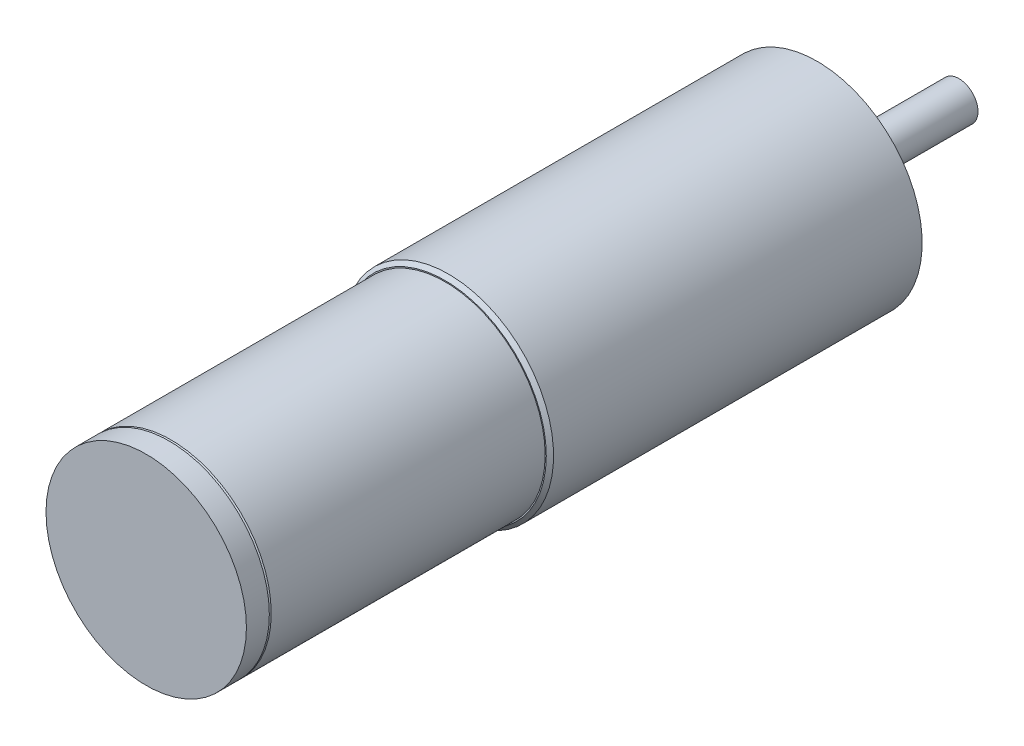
ISO-10303-21;
HEADER;
FILE_DESCRIPTION(('STEP AP214'),'2;1');
FILE_NAME('part.step','',(''),(''),'','','');
FILE_SCHEMA(('AUTOMOTIVE_DESIGN { 1 0 10303 214 1 1 1 1 }'));
ENDSEC;
DATA;
#1=APPLICATION_CONTEXT('core data for automotive mechanical design processes');
#2=APPLICATION_PROTOCOL_DEFINITION('international standard','automotive_design',2000,#1);
#3=PRODUCT_CONTEXT('',#1,'mechanical');
#4=PRODUCT('Part','Part','',(#3));
#5=PRODUCT_RELATED_PRODUCT_CATEGORY('part','',(#4));
#6=PRODUCT_DEFINITION_FORMATION('','',#4);
#7=PRODUCT_DEFINITION_CONTEXT('part definition',#1,'design');
#8=PRODUCT_DEFINITION('design','',#6,#7);
#9=PRODUCT_DEFINITION_SHAPE('','',#8);
#10=(LENGTH_UNIT() NAMED_UNIT(*) SI_UNIT(.MILLI.,.METRE.));
#11=(NAMED_UNIT(*) PLANE_ANGLE_UNIT() SI_UNIT($,.RADIAN.));
#12=(NAMED_UNIT(*) SI_UNIT($,.STERADIAN.) SOLID_ANGLE_UNIT());
#13=UNCERTAINTY_MEASURE_WITH_UNIT(LENGTH_MEASURE(1.E-05),#10,'distance_accuracy_value','');
#14=(GEOMETRIC_REPRESENTATION_CONTEXT(3) GLOBAL_UNCERTAINTY_ASSIGNED_CONTEXT((#13)) GLOBAL_UNIT_ASSIGNED_CONTEXT((#10,
#11,#12)) REPRESENTATION_CONTEXT('',''));
#15=CARTESIAN_POINT('',(0.,0.,0.));
#16=DIRECTION('',(0.,0.,1.));
#17=DIRECTION('',(1.,0.,0.));
#18=AXIS2_PLACEMENT_3D('',#15,#16,#17);
#19=CARTESIAN_POINT('',(0.,0.,-3.14999999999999));
#20=DIRECTION('',(0.,0.,-0.999999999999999));
#21=DIRECTION('',(-1.,0.,0.));
#22=AXIS2_PLACEMENT_3D('',#19,#20,#21);
#23=PLANE('',#22);
#24=CARTESIAN_POINT('',(0.,0.,-3.14999999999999));
#25=DIRECTION('',(0.,0.,-0.999999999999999));
#26=DIRECTION('',(-1.,0.,0.));
#27=AXIS2_PLACEMENT_3D('',#24,#25,#26);
#28=CIRCLE('',#27,5.);
#29=CARTESIAN_POINT('',(5.,0.,-3.14999999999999));
#30=VERTEX_POINT('',#29);
#31=EDGE_CURVE('E368',#30,#30,#28,.T.);
#32=ORIENTED_EDGE('',*,*,#31,.T.);
#33=EDGE_LOOP('',(#32));
#34=FACE_BOUND('',#33,.T.);
#35=CARTESIAN_POINT('',(0.,0.,-3.14999999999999));
#36=DIRECTION('',(0.,0.,-0.999999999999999));
#37=DIRECTION('',(-1.,0.,0.));
#38=AXIS2_PLACEMENT_3D('',#35,#36,#37);
#39=CIRCLE('',#38,2.);
#40=CARTESIAN_POINT('',(1.99999999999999,0.,-3.14999999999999));
#41=VERTEX_POINT('',#40);
#42=EDGE_CURVE('E366',#41,#41,#39,.F.);
#43=ORIENTED_EDGE('',*,*,#42,.T.);
#44=EDGE_LOOP('',(#43));
#45=FACE_BOUND('',#44,.T.);
#46=ADVANCED_FACE('F348',(#34,#45),#23,.T.);
#47=CARTESIAN_POINT('',(0.,0.,0.));
#48=DIRECTION('',(0.,0.,0.999999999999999));
#49=DIRECTION('',(1.,0.,0.));
#50=AXIS2_PLACEMENT_3D('',#47,#48,#49);
#51=PLANE('',#50);
#52=CARTESIAN_POINT('',(0.,0.,0.));
#53=DIRECTION('',(0.,0.,0.999999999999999));
#54=DIRECTION('',(1.,0.,0.));
#55=AXIS2_PLACEMENT_3D('',#52,#53,#54);
#56=CIRCLE('',#55,11.);
#57=CARTESIAN_POINT('',(-11.,-2.63677968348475E-13,0.));
#58=VERTEX_POINT('',#57);
#59=EDGE_CURVE('E376',#58,#58,#56,.T.);
#60=ORIENTED_EDGE('',*,*,#59,.F.);
#61=EDGE_LOOP('',(#60));
#62=FACE_BOUND('',#61,.T.);
#63=CARTESIAN_POINT('',(0.,0.,0.));
#64=DIRECTION('',(0.,0.,0.999999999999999));
#65=DIRECTION('',(1.,0.,0.));
#66=AXIS2_PLACEMENT_3D('',#63,#64,#65);
#67=CIRCLE('',#66,5.);
#68=CARTESIAN_POINT('',(5.,0.,0.));
#69=VERTEX_POINT('',#68);
#70=EDGE_CURVE('E359',#69,#69,#67,.F.);
#71=ORIENTED_EDGE('',*,*,#70,.F.);
#72=EDGE_LOOP('',(#71));
#73=FACE_BOUND('',#72,.T.);
#74=ADVANCED_FACE('F405',(#62,#73),#51,.F.);
#75=CARTESIAN_POINT('',(0.,-2.63677968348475E-13,39.));
#76=DIRECTION('',(0.,0.,0.999999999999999));
#77=DIRECTION('',(1.,0.,0.));
#78=AXIS2_PLACEMENT_3D('',#75,#76,#77);
#79=PLANE('',#78);
#80=CARTESIAN_POINT('',(0.,-2.63677968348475E-13,39.));
#81=DIRECTION('',(0.,0.,0.999999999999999));
#82=DIRECTION('',(1.,0.,0.));
#83=AXIS2_PLACEMENT_3D('',#80,#81,#82);
#84=CIRCLE('',#83,10.619);
#85=CARTESIAN_POINT('',(-10.619,-2.63677968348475E-13,39.));
#86=VERTEX_POINT('',#85);
#87=EDGE_CURVE('E373',#86,#86,#84,.T.);
#88=ORIENTED_EDGE('',*,*,#87,.T.);
#89=EDGE_LOOP('',(#88));
#90=FACE_BOUND('',#89,.T.);
#91=CARTESIAN_POINT('',(0.,-2.63677968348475E-13,39.));
#92=DIRECTION('',(0.,0.,0.999999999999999));
#93=DIRECTION('',(1.,0.,0.));
#94=AXIS2_PLACEMENT_3D('',#91,#92,#93);
#95=CIRCLE('',#94,10.5);
#96=CARTESIAN_POINT('',(-10.5,0.,39.));
#97=VERTEX_POINT('',#96);
#98=EDGE_CURVE('E379',#97,#97,#95,.T.);
#99=ORIENTED_EDGE('',*,*,#98,.F.);
#100=EDGE_LOOP('',(#99));
#101=FACE_BOUND('',#100,.T.);
#102=ADVANCED_FACE('F411',(#90,#101),#79,.T.);
#103=CARTESIAN_POINT('',(0.,-2.63677968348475E-13,39.));
#104=DIRECTION('',(0.,0.,-0.999999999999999));
#105=DIRECTION('',(-1.,0.,0.));
#106=AXIS2_PLACEMENT_3D('',#103,#104,#105);
#107=CYLINDRICAL_SURFACE('',#106,11.);
#108=CARTESIAN_POINT('',(0.,-2.63677968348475E-13,38.619));
#109=DIRECTION('',(0.,0.,0.999999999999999));
#110=DIRECTION('',(1.,0.,0.));
#111=AXIS2_PLACEMENT_3D('',#108,#109,#110);
#112=CIRCLE('',#111,11.);
#113=CARTESIAN_POINT('',(-11.,-2.63677968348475E-13,38.619));
#114=VERTEX_POINT('',#113);
#115=EDGE_CURVE('E363',#114,#114,#112,.F.);
#116=CARTESIAN_POINT('',(-11.,-2.63677968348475E-13,38.619));
#117=CARTESIAN_POINT('',(-11.,-2.63677968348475E-13,38.21671875));
#118=CARTESIAN_POINT('',(-11.,-2.63677968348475E-13,37.8144375));
#119=CARTESIAN_POINT('',(-11.,-2.63677968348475E-13,37.009875));
#120=CARTESIAN_POINT('',(-11.,-2.63677968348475E-13,36.60759375));
#121=CARTESIAN_POINT('',(-11.,-2.63677968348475E-13,35.80303125));
#122=CARTESIAN_POINT('',(-11.,-2.63677968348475E-13,35.40075));
#123=CARTESIAN_POINT('',(-11.,-2.63677968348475E-13,34.5961875));
#124=CARTESIAN_POINT('',(-11.,-2.63677968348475E-13,34.19390625));
#125=CARTESIAN_POINT('',(-11.,-2.63677968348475E-13,33.38934375));
#126=CARTESIAN_POINT('',(-11.,-2.63677968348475E-13,32.9870625));
#127=CARTESIAN_POINT('',(-11.,-2.63677968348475E-13,32.1825));
#128=CARTESIAN_POINT('',(-11.,-2.63677968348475E-13,31.78021875));
#129=CARTESIAN_POINT('',(-11.,-2.63677968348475E-13,30.97565625));
#130=CARTESIAN_POINT('',(-11.,-2.63677968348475E-13,30.573375));
#131=CARTESIAN_POINT('',(-11.,-2.63677968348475E-13,29.7688125));
#132=CARTESIAN_POINT('',(-11.,-2.63677968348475E-13,29.36653125));
#133=CARTESIAN_POINT('',(-11.,-2.63677968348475E-13,28.56196875));
#134=CARTESIAN_POINT('',(-11.,-2.63677968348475E-13,28.1596875));
#135=CARTESIAN_POINT('',(-11.,-2.63677968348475E-13,27.355125));
#136=CARTESIAN_POINT('',(-11.,-2.63677968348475E-13,26.95284375));
#137=CARTESIAN_POINT('',(-11.,-2.63677968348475E-13,26.14828125));
#138=CARTESIAN_POINT('',(-11.,-2.63677968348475E-13,25.746));
#139=CARTESIAN_POINT('',(-11.,-2.63677968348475E-13,24.9414375));
#140=CARTESIAN_POINT('',(-11.,-2.63677968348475E-13,24.53915625));
#141=CARTESIAN_POINT('',(-11.,-2.63677968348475E-13,23.73459375));
#142=CARTESIAN_POINT('',(-11.,-2.63677968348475E-13,23.3323125));
#143=CARTESIAN_POINT('',(-11.,-2.63677968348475E-13,22.52775));
#144=CARTESIAN_POINT('',(-11.,-2.63677968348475E-13,22.12546875));
#145=CARTESIAN_POINT('',(-11.,-2.63677968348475E-13,21.32090625));
#146=CARTESIAN_POINT('',(-11.,-2.63677968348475E-13,20.918625));
#147=CARTESIAN_POINT('',(-11.,-2.63677968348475E-13,20.1140625));
#148=CARTESIAN_POINT('',(-11.,-2.63677968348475E-13,19.71178125));
#149=CARTESIAN_POINT('',(-11.,-2.63677968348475E-13,18.90721875));
#150=CARTESIAN_POINT('',(-11.,-2.63677968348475E-13,18.5049375));
#151=CARTESIAN_POINT('',(-11.,-2.63677968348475E-13,17.700375));
#152=CARTESIAN_POINT('',(-11.,-2.63677968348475E-13,17.29809375));
#153=CARTESIAN_POINT('',(-11.,-2.63677968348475E-13,16.49353125));
#154=CARTESIAN_POINT('',(-11.,-2.63677968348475E-13,16.09125));
#155=CARTESIAN_POINT('',(-11.,-2.63677968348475E-13,15.2866875));
#156=CARTESIAN_POINT('',(-11.,-2.63677968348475E-13,14.88440625));
#157=CARTESIAN_POINT('',(-11.,-2.63677968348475E-13,14.07984375));
#158=CARTESIAN_POINT('',(-11.,-2.63677968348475E-13,13.6775625));
#159=CARTESIAN_POINT('',(-11.,-2.63677968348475E-13,12.873));
#160=CARTESIAN_POINT('',(-11.,-2.63677968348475E-13,12.47071875));
#161=CARTESIAN_POINT('',(-11.,-2.63677968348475E-13,11.66615625));
#162=CARTESIAN_POINT('',(-11.,-2.63677968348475E-13,11.263875));
#163=CARTESIAN_POINT('',(-11.,-2.63677968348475E-13,10.4593125));
#164=CARTESIAN_POINT('',(-11.,-2.63677968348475E-13,10.05703125));
#165=CARTESIAN_POINT('',(-11.,-2.63677968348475E-13,9.25246875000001));
#166=CARTESIAN_POINT('',(-11.,-2.63677968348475E-13,8.85018750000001));
#167=CARTESIAN_POINT('',(-11.,-2.63677968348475E-13,8.045625));
#168=CARTESIAN_POINT('',(-11.,-2.63677968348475E-13,7.64334375));
#169=CARTESIAN_POINT('',(-11.,-2.63677968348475E-13,6.83878125));
#170=CARTESIAN_POINT('',(-11.,-2.63677968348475E-13,6.4365));
#171=CARTESIAN_POINT('',(-11.,-2.63677968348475E-13,5.6319375));
#172=CARTESIAN_POINT('',(-11.,-2.63677968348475E-13,5.22965625));
#173=CARTESIAN_POINT('',(-11.,-2.63677968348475E-13,4.42509374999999));
#174=CARTESIAN_POINT('',(-11.,-2.63677968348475E-13,4.0228125));
#175=CARTESIAN_POINT('',(-11.,-2.63677968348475E-13,3.21825));
#176=CARTESIAN_POINT('',(-11.,-2.63677968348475E-13,2.81596875));
#177=CARTESIAN_POINT('',(-11.,-2.63677968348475E-13,2.01140625));
#178=CARTESIAN_POINT('',(-11.,-2.63677968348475E-13,1.609125));
#179=CARTESIAN_POINT('',(-11.,-2.63677968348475E-13,0.804562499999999));
#180=CARTESIAN_POINT('',(-11.,-2.63677968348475E-13,0.402281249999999));
#181=CARTESIAN_POINT('',(-11.,-2.63677968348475E-13,0.));
#182=B_SPLINE_CURVE_WITH_KNOTS('',3,(#116,#117,#118,#119,#120,#121,#122,#123,#124,#125,#126,
#127,#128,#129,#130,#131,#132,#133,#134,#135,#136,#137,#138,#139,#140,#141,#142,#143,#144,#145,
#146,#147,#148,#149,#150,#151,#152,#153,#154,#155,#156,#157,#158,#159,#160,#161,#162,#163,#164,
#165,#166,#167,#168,#169,#170,#171,#172,#173,#174,#175,#176,#177,#178,#179,#180,#181),
.UNSPECIFIED.,.F.,.F.,(4,2,2,2,2,2,2,2,2,2,2,2,2,2,2,2,2,2,2,2,2,2,2,2,2,2,2,2,2,2,2,2,4),(0.,
1.20684375,2.4136875,3.62053125,4.82737499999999,6.03421875,7.2410625,8.44790625,9.65475,
10.86159375,12.0684375,13.27528125,14.482125,15.68896875,16.8958125,18.10265625,19.3095,
20.51634375,21.7231875,22.93003125,24.136875,25.34371875,26.5505625,27.75740625,28.96425,
30.17109375,31.3779375,32.58478125,33.791625,34.99846875,36.2053125,37.41215625,38.619),.UNSPECIFIED.);
#183=EDGE_CURVE('BSEAM350',#114,#58,#182,.T.);
#184=ORIENTED_EDGE('',*,*,#115,.T.);
#185=ORIENTED_EDGE('',*,*,#59,.T.);
#186=ORIENTED_EDGE('',*,*,#183,.T.);
#187=ORIENTED_EDGE('',*,*,#183,.F.);
#188=EDGE_LOOP('',(#184,#186,#185,#187));
#189=FACE_BOUND('',#188,.T.);
#190=ADVANCED_FACE('F350',(#189),#107,.T.);
#191=CARTESIAN_POINT('',(0.,-2.63677968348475E-13,39.));
#192=DIRECTION('',(0.,0.,-0.999999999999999));
#193=DIRECTION('',(-1.,0.,0.));
#194=AXIS2_PLACEMENT_3D('',#191,#192,#193);
#195=CONICAL_SURFACE('',#194,10.619,0.785398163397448);
#196=CARTESIAN_POINT('',(-11.,-2.63677968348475E-13,38.619));
#197=CARTESIAN_POINT('',(-10.99603125,-2.63677968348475E-13,38.62296875));
#198=CARTESIAN_POINT('',(-10.9920625,-2.63677968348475E-13,38.6269375));
#199=CARTESIAN_POINT('',(-10.984125,-2.63677968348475E-13,38.634875));
#200=CARTESIAN_POINT('',(-10.98015625,-2.63677968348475E-13,38.63884375));
#201=CARTESIAN_POINT('',(-10.97221875,-2.63677968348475E-13,38.64678125));
#202=CARTESIAN_POINT('',(-10.96825,-2.63677968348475E-13,38.65075));
#203=CARTESIAN_POINT('',(-10.9603125,-2.63677968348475E-13,38.6586875));
#204=CARTESIAN_POINT('',(-10.95634375,-2.63677968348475E-13,38.66265625));
#205=CARTESIAN_POINT('',(-10.94840625,-2.63677968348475E-13,38.67059375));
#206=CARTESIAN_POINT('',(-10.9444375,-2.63677968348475E-13,38.6745625));
#207=CARTESIAN_POINT('',(-10.9365,-2.63677968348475E-13,38.6825));
#208=CARTESIAN_POINT('',(-10.93253125,-2.63677968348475E-13,38.68646875));
#209=CARTESIAN_POINT('',(-10.92459375,-2.63677968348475E-13,38.69440625));
#210=CARTESIAN_POINT('',(-10.920625,-2.63677968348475E-13,38.698375));
#211=CARTESIAN_POINT('',(-10.9126875,-2.63677968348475E-13,38.7063125));
#212=CARTESIAN_POINT('',(-10.90871875,-2.63677968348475E-13,38.71028125));
#213=CARTESIAN_POINT('',(-10.90078125,-2.63677968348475E-13,38.71821875));
#214=CARTESIAN_POINT('',(-10.8968125,-2.63677968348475E-13,38.7221875));
#215=CARTESIAN_POINT('',(-10.888875,-2.63677968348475E-13,38.730125));
#216=CARTESIAN_POINT('',(-10.88490625,-2.63677968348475E-13,38.73409375));
#217=CARTESIAN_POINT('',(-10.87696875,-2.63677968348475E-13,38.74203125));
#218=CARTESIAN_POINT('',(-10.873,-2.63677968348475E-13,38.746));
#219=CARTESIAN_POINT('',(-10.8650625,-2.63677968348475E-13,38.7539375));
#220=CARTESIAN_POINT('',(-10.86109375,-2.63677968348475E-13,38.75790625));
#221=CARTESIAN_POINT('',(-10.85315625,-2.63677968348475E-13,38.76584375));
#222=CARTESIAN_POINT('',(-10.8491875,-2.63677968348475E-13,38.7698125));
#223=CARTESIAN_POINT('',(-10.84125,-2.63677968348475E-13,38.77775));
#224=CARTESIAN_POINT('',(-10.83728125,-2.63677968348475E-13,38.78171875));
#225=CARTESIAN_POINT('',(-10.82934375,-2.63677968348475E-13,38.78965625));
#226=CARTESIAN_POINT('',(-10.825375,-2.63677968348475E-13,38.793625));
#227=CARTESIAN_POINT('',(-10.8174375,-2.63677968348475E-13,38.8015625));
#228=CARTESIAN_POINT('',(-10.81346875,-2.63677968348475E-13,38.80553125));
#229=CARTESIAN_POINT('',(-10.80553125,-2.63677968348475E-13,38.81346875));
#230=CARTESIAN_POINT('',(-10.8015625,-2.63677968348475E-13,38.8174375));
#231=CARTESIAN_POINT('',(-10.793625,-2.63677968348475E-13,38.825375));
#232=CARTESIAN_POINT('',(-10.78965625,-2.63677968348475E-13,38.82934375));
#233=CARTESIAN_POINT('',(-10.78171875,-2.63677968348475E-13,38.83728125));
#234=CARTESIAN_POINT('',(-10.77775,-2.63677968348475E-13,38.84125));
#235=CARTESIAN_POINT('',(-10.7698125,-2.63677968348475E-13,38.8491875));
#236=CARTESIAN_POINT('',(-10.76584375,-2.63677968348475E-13,38.85315625));
#237=CARTESIAN_POINT('',(-10.75790625,-2.63677968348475E-13,38.86109375));
#238=CARTESIAN_POINT('',(-10.7539375,-2.63677968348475E-13,38.8650625));
#239=CARTESIAN_POINT('',(-10.746,-2.63677968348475E-13,38.873));
#240=CARTESIAN_POINT('',(-10.74203125,-2.63677968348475E-13,38.87696875));
#241=CARTESIAN_POINT('',(-10.73409375,-2.63677968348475E-13,38.88490625));
#242=CARTESIAN_POINT('',(-10.730125,-2.63677968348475E-13,38.888875));
#243=CARTESIAN_POINT('',(-10.7221875,-2.63677968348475E-13,38.8968125));
#244=CARTESIAN_POINT('',(-10.71821875,-2.63677968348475E-13,38.90078125));
#245=CARTESIAN_POINT('',(-10.71028125,-2.63677968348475E-13,38.90871875));
#246=CARTESIAN_POINT('',(-10.7063125,-2.63677968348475E-13,38.9126875));
#247=CARTESIAN_POINT('',(-10.698375,-2.63677968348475E-13,38.920625));
#248=CARTESIAN_POINT('',(-10.69440625,-2.63677968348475E-13,38.92459375));
#249=CARTESIAN_POINT('',(-10.68646875,-2.63677968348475E-13,38.93253125));
#250=CARTESIAN_POINT('',(-10.6825,-2.63677968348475E-13,38.9365));
#251=CARTESIAN_POINT('',(-10.6745625,-2.63677968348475E-13,38.9444375));
#252=CARTESIAN_POINT('',(-10.67059375,-2.63677968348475E-13,38.94840625));
#253=CARTESIAN_POINT('',(-10.66265625,-2.63677968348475E-13,38.95634375));
#254=CARTESIAN_POINT('',(-10.6586875,-2.63677968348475E-13,38.9603125));
#255=CARTESIAN_POINT('',(-10.65075,-2.63677968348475E-13,38.96825));
#256=CARTESIAN_POINT('',(-10.64678125,-2.63677968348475E-13,38.97221875));
#257=CARTESIAN_POINT('',(-10.63884375,-2.63677968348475E-13,38.98015625));
#258=CARTESIAN_POINT('',(-10.634875,-2.63677968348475E-13,38.984125));
#259=CARTESIAN_POINT('',(-10.6269375,-2.63677968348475E-13,38.9920625));
#260=CARTESIAN_POINT('',(-10.62296875,-2.63677968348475E-13,38.99603125));
#261=CARTESIAN_POINT('',(-10.619,-2.63677968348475E-13,39.));
#262=B_SPLINE_CURVE_WITH_KNOTS('',3,(#196,#197,#198,#199,#200,#201,#202,#203,#204,#205,#206,
#207,#208,#209,#210,#211,#212,#213,#214,#215,#216,#217,#218,#219,#220,#221,#222,#223,#224,#225,
#226,#227,#228,#229,#230,#231,#232,#233,#234,#235,#236,#237,#238,#239,#240,#241,#242,#243,#244,
#245,#246,#247,#248,#249,#250,#251,#252,#253,#254,#255,#256,#257,#258,#259,#260,#261),
.UNSPECIFIED.,.F.,.F.,(4,2,2,2,2,2,2,2,2,2,2,2,2,2,2,2,2,2,2,2,2,2,2,2,2,2,2,2,2,2,2,2,4),(0.,
0.016837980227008,0.0336759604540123,0.0505139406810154,0.0673519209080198,0.0841899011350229,
0.101027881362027,0.11786586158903,0.134703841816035,0.151541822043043,0.168379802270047,
0.18521778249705,0.202055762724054,0.218893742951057,0.235731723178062,0.252569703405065,
0.269407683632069,0.286245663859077,0.303083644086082,0.319921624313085,0.336759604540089,
0.353597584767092,0.370435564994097,0.3872735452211,0.404111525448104,0.420949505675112,
0.437787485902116,0.454625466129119,0.471463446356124,0.488301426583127,0.505139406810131,
0.521977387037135,0.538815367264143),.UNSPECIFIED.);
#263=EDGE_CURVE('BSEAM426',#114,#86,#262,.T.);
#264=ORIENTED_EDGE('',*,*,#115,.F.);
#265=ORIENTED_EDGE('',*,*,#87,.F.);
#266=ORIENTED_EDGE('',*,*,#263,.T.);
#267=ORIENTED_EDGE('',*,*,#263,.F.);
#268=EDGE_LOOP('',(#264,#266,#265,#267));
#269=FACE_BOUND('',#268,.T.);
#270=ADVANCED_FACE('F426',(#269),#195,.T.);
#271=CARTESIAN_POINT('',(0.,0.,67.9));
#272=DIRECTION('',(0.,0.,-0.999999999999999));
#273=DIRECTION('',(-1.,0.,0.));
#274=AXIS2_PLACEMENT_3D('',#271,#272,#273);
#275=CYLINDRICAL_SURFACE('',#274,10.5);
#276=CARTESIAN_POINT('',(0.,0.,67.7));
#277=DIRECTION('',(0.,0.,0.999999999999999));
#278=DIRECTION('',(1.,0.,0.));
#279=AXIS2_PLACEMENT_3D('',#276,#277,#278);
#280=CIRCLE('',#279,10.5);
#281=CARTESIAN_POINT('',(-10.5,0.,67.7));
#282=VERTEX_POINT('',#281);
#283=EDGE_CURVE('E10',#282,#282,#280,.F.);
#284=CARTESIAN_POINT('',(-10.5,0.,67.7));
#285=CARTESIAN_POINT('',(-10.5,0.,67.4010416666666));
#286=CARTESIAN_POINT('',(-10.5,0.,67.1020833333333));
#287=CARTESIAN_POINT('',(-10.5,0.,66.5041666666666));
#288=CARTESIAN_POINT('',(-10.5,0.,66.2052083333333));
#289=CARTESIAN_POINT('',(-10.5,0.,65.6072916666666));
#290=CARTESIAN_POINT('',(-10.5,0.,65.3083333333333));
#291=CARTESIAN_POINT('',(-10.5,0.,64.7104166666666));
#292=CARTESIAN_POINT('',(-10.5,0.,64.4114583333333));
#293=CARTESIAN_POINT('',(-10.5,0.,63.8135416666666));
#294=CARTESIAN_POINT('',(-10.5,0.,63.5145833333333));
#295=CARTESIAN_POINT('',(-10.5,0.,62.9166666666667));
#296=CARTESIAN_POINT('',(-10.5,0.,62.6177083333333));
#297=CARTESIAN_POINT('',(-10.5,0.,62.0197916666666));
#298=CARTESIAN_POINT('',(-10.5,0.,61.7208333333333));
#299=CARTESIAN_POINT('',(-10.5,0.,61.1229166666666));
#300=CARTESIAN_POINT('',(-10.5,0.,60.8239583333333));
#301=CARTESIAN_POINT('',(-10.5,0.,60.2260416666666));
#302=CARTESIAN_POINT('',(-10.5,0.,59.9270833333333));
#303=CARTESIAN_POINT('',(-10.5,0.,59.3291666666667));
#304=CARTESIAN_POINT('',(-10.5,0.,59.0302083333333));
#305=CARTESIAN_POINT('',(-10.5,0.,58.4322916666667));
#306=CARTESIAN_POINT('',(-10.5,0.,58.1333333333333));
#307=CARTESIAN_POINT('',(-10.5,0.,57.5354166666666));
#308=CARTESIAN_POINT('',(-10.5,0.,57.2364583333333));
#309=CARTESIAN_POINT('',(-10.5,0.,56.6385416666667));
#310=CARTESIAN_POINT('',(-10.5,0.,56.3395833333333));
#311=CARTESIAN_POINT('',(-10.5,0.,55.7416666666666));
#312=CARTESIAN_POINT('',(-10.5,0.,55.4427083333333));
#313=CARTESIAN_POINT('',(-10.5,0.,54.8447916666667));
#314=CARTESIAN_POINT('',(-10.5,0.,54.5458333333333));
#315=CARTESIAN_POINT('',(-10.5,0.,53.9479166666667));
#316=CARTESIAN_POINT('',(-10.5,0.,53.6489583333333));
#317=CARTESIAN_POINT('',(-10.5,0.,53.0510416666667));
#318=CARTESIAN_POINT('',(-10.5,0.,52.7520833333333));
#319=CARTESIAN_POINT('',(-10.5,0.,52.1541666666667));
#320=CARTESIAN_POINT('',(-10.5,0.,51.8552083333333));
#321=CARTESIAN_POINT('',(-10.5,0.,51.2572916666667));
#322=CARTESIAN_POINT('',(-10.5,0.,50.9583333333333));
#323=CARTESIAN_POINT('',(-10.5,0.,50.3604166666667));
#324=CARTESIAN_POINT('',(-10.5,0.,50.0614583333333));
#325=CARTESIAN_POINT('',(-10.5,0.,49.4635416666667));
#326=CARTESIAN_POINT('',(-10.5,0.,49.1645833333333));
#327=CARTESIAN_POINT('',(-10.5,0.,48.5666666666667));
#328=CARTESIAN_POINT('',(-10.5,0.,48.2677083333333));
#329=CARTESIAN_POINT('',(-10.5,0.,47.6697916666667));
#330=CARTESIAN_POINT('',(-10.5,0.,47.3708333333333));
#331=CARTESIAN_POINT('',(-10.5,0.,46.7729166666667));
#332=CARTESIAN_POINT('',(-10.5,0.,46.4739583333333));
#333=CARTESIAN_POINT('',(-10.5,0.,45.8760416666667));
#334=CARTESIAN_POINT('',(-10.5,0.,45.5770833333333));
#335=CARTESIAN_POINT('',(-10.5,0.,44.9791666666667));
#336=CARTESIAN_POINT('',(-10.5,0.,44.6802083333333));
#337=CARTESIAN_POINT('',(-10.5,0.,44.0822916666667));
#338=CARTESIAN_POINT('',(-10.5,0.,43.7833333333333));
#339=CARTESIAN_POINT('',(-10.5,0.,43.1854166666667));
#340=CARTESIAN_POINT('',(-10.5,0.,42.8864583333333));
#341=CARTESIAN_POINT('',(-10.5,0.,42.2885416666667));
#342=CARTESIAN_POINT('',(-10.5,0.,41.9895833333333));
#343=CARTESIAN_POINT('',(-10.5,0.,41.3916666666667));
#344=CARTESIAN_POINT('',(-10.5,0.,41.0927083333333));
#345=CARTESIAN_POINT('',(-10.5,0.,40.4947916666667));
#346=CARTESIAN_POINT('',(-10.5,0.,40.1958333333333));
#347=CARTESIAN_POINT('',(-10.5,0.,39.5979166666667));
#348=CARTESIAN_POINT('',(-10.5,0.,39.2989583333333));
#349=CARTESIAN_POINT('',(-10.5,0.,39.));
#350=B_SPLINE_CURVE_WITH_KNOTS('',3,(#284,#285,#286,#287,#288,#289,#290,#291,#292,#293,#294,
#295,#296,#297,#298,#299,#300,#301,#302,#303,#304,#305,#306,#307,#308,#309,#310,#311,#312,#313,
#314,#315,#316,#317,#318,#319,#320,#321,#322,#323,#324,#325,#326,#327,#328,#329,#330,#331,#332,
#333,#334,#335,#336,#337,#338,#339,#340,#341,#342,#343,#344,#345,#346,#347,#348,#349),
.UNSPECIFIED.,.F.,.F.,(4,2,2,2,2,2,2,2,2,2,2,2,2,2,2,2,2,2,2,2,2,2,2,2,2,2,2,2,2,2,2,2,4),(0.,
0.896874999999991,1.79375,2.69062499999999,3.58749999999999,4.48437499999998,5.38124999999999,
6.27812499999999,7.17499999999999,8.07187499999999,8.96874999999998,9.86562499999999,10.7625,
11.659375,12.55625,13.453125,14.35,15.246875,16.14375,17.040625,17.9375,18.834375,19.73125,
20.628125,21.525,22.421875,23.31875,24.215625,25.1125,26.009375,26.90625,27.803125,28.7),.UNSPECIFIED.);
#351=EDGE_CURVE('BSEAM422',#282,#97,#350,.T.);
#352=ORIENTED_EDGE('',*,*,#283,.T.);
#353=ORIENTED_EDGE('',*,*,#98,.T.);
#354=ORIENTED_EDGE('',*,*,#351,.T.);
#355=ORIENTED_EDGE('',*,*,#351,.F.);
#356=EDGE_LOOP('',(#352,#354,#353,#355));
#357=FACE_BOUND('',#356,.T.);
#358=ADVANCED_FACE('F422',(#357),#275,.T.);
#359=CARTESIAN_POINT('',(0.,0.,-3.14999999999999));
#360=DIRECTION('',(0.,0.,0.999999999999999));
#361=DIRECTION('',(1.,0.,0.));
#362=AXIS2_PLACEMENT_3D('',#359,#360,#361);
#363=CYLINDRICAL_SURFACE('',#362,5.);
#364=CARTESIAN_POINT('',(5.,0.,-3.14999999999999));
#365=CARTESIAN_POINT('',(5.,0.,-3.11718749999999));
#366=CARTESIAN_POINT('',(5.,0.,-3.08437499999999));
#367=CARTESIAN_POINT('',(5.,0.,-3.01874999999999));
#368=CARTESIAN_POINT('',(5.,0.,-2.98593749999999));
#369=CARTESIAN_POINT('',(5.,0.,-2.92031249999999));
#370=CARTESIAN_POINT('',(5.,0.,-2.88749999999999));
#371=CARTESIAN_POINT('',(5.,0.,-2.82187499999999));
#372=CARTESIAN_POINT('',(5.,0.,-2.78906249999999));
#373=CARTESIAN_POINT('',(5.,0.,-2.72343749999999));
#374=CARTESIAN_POINT('',(5.,0.,-2.69062499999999));
#375=CARTESIAN_POINT('',(5.,0.,-2.62499999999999));
#376=CARTESIAN_POINT('',(5.,0.,-2.59218749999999));
#377=CARTESIAN_POINT('',(5.,0.,-2.52656249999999));
#378=CARTESIAN_POINT('',(5.,0.,-2.49374999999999));
#379=CARTESIAN_POINT('',(5.,0.,-2.42812499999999));
#380=CARTESIAN_POINT('',(5.,0.,-2.39531249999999));
#381=CARTESIAN_POINT('',(5.,0.,-2.32968749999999));
#382=CARTESIAN_POINT('',(5.,0.,-2.29687499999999));
#383=CARTESIAN_POINT('',(5.,0.,-2.23124999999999));
#384=CARTESIAN_POINT('',(5.,0.,-2.19843749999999));
#385=CARTESIAN_POINT('',(5.,0.,-2.13281249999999));
#386=CARTESIAN_POINT('',(5.,0.,-2.09999999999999));
#387=CARTESIAN_POINT('',(5.,0.,-2.03437499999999));
#388=CARTESIAN_POINT('',(5.,0.,-2.00156249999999));
#389=CARTESIAN_POINT('',(5.,0.,-1.93593749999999));
#390=CARTESIAN_POINT('',(5.,0.,-1.90312499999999));
#391=CARTESIAN_POINT('',(5.,0.,-1.83749999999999));
#392=CARTESIAN_POINT('',(5.,0.,-1.80468749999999));
#393=CARTESIAN_POINT('',(5.,0.,-1.73906249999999));
#394=CARTESIAN_POINT('',(5.,0.,-1.70624999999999));
#395=CARTESIAN_POINT('',(5.,0.,-1.64062499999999));
#396=CARTESIAN_POINT('',(5.,0.,-1.60781249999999));
#397=CARTESIAN_POINT('',(5.,0.,-1.54218749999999));
#398=CARTESIAN_POINT('',(5.,0.,-1.50937499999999));
#399=CARTESIAN_POINT('',(5.,0.,-1.44374999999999));
#400=CARTESIAN_POINT('',(5.,0.,-1.41093749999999));
#401=CARTESIAN_POINT('',(5.,0.,-1.34531249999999));
#402=CARTESIAN_POINT('',(5.,0.,-1.31249999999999));
#403=CARTESIAN_POINT('',(5.,0.,-1.24687499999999));
#404=CARTESIAN_POINT('',(5.,0.,-1.21406249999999));
#405=CARTESIAN_POINT('',(5.,0.,-1.14843749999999));
#406=CARTESIAN_POINT('',(5.,0.,-1.11562499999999));
#407=CARTESIAN_POINT('',(5.,0.,-1.04999999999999));
#408=CARTESIAN_POINT('',(5.,0.,-1.0171875));
#409=CARTESIAN_POINT('',(5.,0.,-0.951562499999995));
#410=CARTESIAN_POINT('',(5.,0.,-0.918749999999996));
#411=CARTESIAN_POINT('',(5.,0.,-0.853124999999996));
#412=CARTESIAN_POINT('',(5.,0.,-0.820312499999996));
#413=CARTESIAN_POINT('',(5.,0.,-0.754687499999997));
#414=CARTESIAN_POINT('',(5.,0.,-0.721874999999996));
#415=CARTESIAN_POINT('',(5.,0.,-0.656249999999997));
#416=CARTESIAN_POINT('',(5.,0.,-0.623437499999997));
#417=CARTESIAN_POINT('',(5.,0.,-0.557812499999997));
#418=CARTESIAN_POINT('',(5.,0.,-0.524999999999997));
#419=CARTESIAN_POINT('',(5.,0.,-0.459374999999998));
#420=CARTESIAN_POINT('',(5.,0.,-0.426562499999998));
#421=CARTESIAN_POINT('',(5.,0.,-0.360937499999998));
#422=CARTESIAN_POINT('',(5.,0.,-0.328124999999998));
#423=CARTESIAN_POINT('',(5.,0.,-0.262499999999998));
#424=CARTESIAN_POINT('',(5.,0.,-0.229687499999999));
#425=CARTESIAN_POINT('',(5.,0.,-0.164062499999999));
#426=CARTESIAN_POINT('',(5.,0.,-0.131249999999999));
#427=CARTESIAN_POINT('',(5.,0.,-0.0656249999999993));
#428=CARTESIAN_POINT('',(5.,0.,-0.0328124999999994));
#429=CARTESIAN_POINT('',(5.,0.,0.));
#430=B_SPLINE_CURVE_WITH_KNOTS('',3,(#364,#365,#366,#367,#368,#369,#370,#371,#372,#373,#374,
#375,#376,#377,#378,#379,#380,#381,#382,#383,#384,#385,#386,#387,#388,#389,#390,#391,#392,#393,
#394,#395,#396,#397,#398,#399,#400,#401,#402,#403,#404,#405,#406,#407,#408,#409,#410,#411,#412,
#413,#414,#415,#416,#417,#418,#419,#420,#421,#422,#423,#424,#425,#426,#427,#428,#429),
.UNSPECIFIED.,.F.,.F.,(4,2,2,2,2,2,2,2,2,2,2,2,2,2,2,2,2,2,2,2,2,2,2,2,2,2,2,2,2,2,2,2,4),(0.,
0.0984375,0.196875,0.295312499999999,0.393749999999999,0.492187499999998,0.590624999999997,
0.689062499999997,0.787499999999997,0.885937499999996,0.984374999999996,1.0828125,
1.18124999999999,1.27968749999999,1.37812499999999,1.47656249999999,1.57499999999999,
1.67343749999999,1.77187499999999,1.87031249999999,1.96874999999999,2.06718749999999,
2.16562499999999,2.26406249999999,2.36249999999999,2.46093749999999,2.55937499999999,
2.65781249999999,2.75624999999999,2.85468749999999,2.95312499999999,3.05156249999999,
3.14999999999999),.UNSPECIFIED.);
#431=EDGE_CURVE('BSEAM419',#30,#69,#430,.T.);
#432=ORIENTED_EDGE('',*,*,#31,.F.);
#433=ORIENTED_EDGE('',*,*,#70,.T.);
#434=ORIENTED_EDGE('',*,*,#431,.T.);
#435=ORIENTED_EDGE('',*,*,#431,.F.);
#436=EDGE_LOOP('',(#432,#434,#433,#435));
#437=FACE_BOUND('',#436,.T.);
#438=ADVANCED_FACE('F419',(#437),#363,.T.);
#439=CARTESIAN_POINT('',(0.,0.,-14.85));
#440=DIRECTION('',(0.,0.,0.999999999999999));
#441=DIRECTION('',(1.,0.,0.));
#442=AXIS2_PLACEMENT_3D('',#439,#440,#441);
#443=CYLINDRICAL_SURFACE('',#442,2.);
#444=CARTESIAN_POINT('',(0.,0.,-14.85));
#445=DIRECTION('',(0.,0.,-0.999999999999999));
#446=DIRECTION('',(-1.,0.,0.));
#447=AXIS2_PLACEMENT_3D('',#444,#445,#446);
#448=CIRCLE('',#447,2.);
#449=CARTESIAN_POINT('',(1.99999999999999,0.,-14.85));
#450=VERTEX_POINT('',#449);
#451=EDGE_CURVE('E369',#450,#450,#448,.T.);
#452=CARTESIAN_POINT('',(1.99999999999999,0.,-3.14999999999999));
#453=CARTESIAN_POINT('',(1.99999999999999,0.,-3.27187499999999));
#454=CARTESIAN_POINT('',(1.99999999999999,0.,-3.39374999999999));
#455=CARTESIAN_POINT('',(1.99999999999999,0.,-3.63749999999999));
#456=CARTESIAN_POINT('',(1.99999999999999,0.,-3.75937499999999));
#457=CARTESIAN_POINT('',(1.99999999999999,0.,-4.00312499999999));
#458=CARTESIAN_POINT('',(1.99999999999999,0.,-4.12499999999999));
#459=CARTESIAN_POINT('',(1.99999999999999,0.,-4.36874999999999));
#460=CARTESIAN_POINT('',(1.99999999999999,0.,-4.49062499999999));
#461=CARTESIAN_POINT('',(1.99999999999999,0.,-4.73437499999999));
#462=CARTESIAN_POINT('',(1.99999999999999,0.,-4.85624999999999));
#463=CARTESIAN_POINT('',(1.99999999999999,0.,-5.09999999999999));
#464=CARTESIAN_POINT('',(1.99999999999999,0.,-5.22187499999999));
#465=CARTESIAN_POINT('',(1.99999999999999,0.,-5.46562499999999));
#466=CARTESIAN_POINT('',(1.99999999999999,0.,-5.58749999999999));
#467=CARTESIAN_POINT('',(1.99999999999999,0.,-5.83124999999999));
#468=CARTESIAN_POINT('',(1.99999999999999,0.,-5.95312499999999));
#469=CARTESIAN_POINT('',(1.99999999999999,0.,-6.19687499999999));
#470=CARTESIAN_POINT('',(1.99999999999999,0.,-6.31874999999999));
#471=CARTESIAN_POINT('',(1.99999999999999,0.,-6.56249999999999));
#472=CARTESIAN_POINT('',(1.99999999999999,0.,-6.68437499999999));
#473=CARTESIAN_POINT('',(1.99999999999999,0.,-6.92812499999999));
#474=CARTESIAN_POINT('',(1.99999999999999,0.,-7.04999999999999));
#475=CARTESIAN_POINT('',(1.99999999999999,0.,-7.29374999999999));
#476=CARTESIAN_POINT('',(1.99999999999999,0.,-7.41562499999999));
#477=CARTESIAN_POINT('',(1.99999999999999,0.,-7.65937499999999));
#478=CARTESIAN_POINT('',(1.99999999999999,0.,-7.78124999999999));
#479=CARTESIAN_POINT('',(1.99999999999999,0.,-8.02499999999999));
#480=CARTESIAN_POINT('',(1.99999999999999,0.,-8.14687499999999));
#481=CARTESIAN_POINT('',(1.99999999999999,0.,-8.39062499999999));
#482=CARTESIAN_POINT('',(1.99999999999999,0.,-8.51249999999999));
#483=CARTESIAN_POINT('',(1.99999999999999,0.,-8.75624999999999));
#484=CARTESIAN_POINT('',(1.99999999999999,0.,-8.87812499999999));
#485=CARTESIAN_POINT('',(1.99999999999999,0.,-9.12187499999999));
#486=CARTESIAN_POINT('',(1.99999999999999,0.,-9.24375));
#487=CARTESIAN_POINT('',(1.99999999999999,0.,-9.4875));
#488=CARTESIAN_POINT('',(1.99999999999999,0.,-9.60937499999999));
#489=CARTESIAN_POINT('',(1.99999999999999,0.,-9.853125));
#490=CARTESIAN_POINT('',(1.99999999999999,0.,-9.975));
#491=CARTESIAN_POINT('',(1.99999999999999,0.,-10.21875));
#492=CARTESIAN_POINT('',(1.99999999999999,0.,-10.340625));
#493=CARTESIAN_POINT('',(1.99999999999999,0.,-10.584375));
#494=CARTESIAN_POINT('',(1.99999999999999,0.,-10.70625));
#495=CARTESIAN_POINT('',(1.99999999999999,0.,-10.95));
#496=CARTESIAN_POINT('',(1.99999999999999,0.,-11.071875));
#497=CARTESIAN_POINT('',(1.99999999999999,0.,-11.315625));
#498=CARTESIAN_POINT('',(1.99999999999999,0.,-11.4375));
#499=CARTESIAN_POINT('',(1.99999999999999,0.,-11.68125));
#500=CARTESIAN_POINT('',(1.99999999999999,0.,-11.803125));
#501=CARTESIAN_POINT('',(1.99999999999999,0.,-12.046875));
#502=CARTESIAN_POINT('',(1.99999999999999,0.,-12.16875));
#503=CARTESIAN_POINT('',(1.99999999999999,0.,-12.4125));
#504=CARTESIAN_POINT('',(1.99999999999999,0.,-12.534375));
#505=CARTESIAN_POINT('',(1.99999999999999,0.,-12.778125));
#506=CARTESIAN_POINT('',(1.99999999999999,0.,-12.9));
#507=CARTESIAN_POINT('',(1.99999999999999,0.,-13.14375));
#508=CARTESIAN_POINT('',(1.99999999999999,0.,-13.265625));
#509=CARTESIAN_POINT('',(1.99999999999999,0.,-13.509375));
#510=CARTESIAN_POINT('',(1.99999999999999,0.,-13.63125));
#511=CARTESIAN_POINT('',(1.99999999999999,0.,-13.875));
#512=CARTESIAN_POINT('',(1.99999999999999,0.,-13.996875));
#513=CARTESIAN_POINT('',(1.99999999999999,0.,-14.240625));
#514=CARTESIAN_POINT('',(1.99999999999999,0.,-14.3625));
#515=CARTESIAN_POINT('',(1.99999999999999,0.,-14.60625));
#516=CARTESIAN_POINT('',(1.99999999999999,0.,-14.728125));
#517=CARTESIAN_POINT('',(1.99999999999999,0.,-14.85));
#518=B_SPLINE_CURVE_WITH_KNOTS('',3,(#452,#453,#454,#455,#456,#457,#458,#459,#460,#461,#462,
#463,#464,#465,#466,#467,#468,#469,#470,#471,#472,#473,#474,#475,#476,#477,#478,#479,#480,#481,
#482,#483,#484,#485,#486,#487,#488,#489,#490,#491,#492,#493,#494,#495,#496,#497,#498,#499,#500,
#501,#502,#503,#504,#505,#506,#507,#508,#509,#510,#511,#512,#513,#514,#515,#516,#517),
.UNSPECIFIED.,.F.,.F.,(4,2,2,2,2,2,2,2,2,2,2,2,2,2,2,2,2,2,2,2,2,2,2,2,2,2,2,2,2,2,2,2,4),(0.,
0.365625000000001,0.731250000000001,1.096875,1.4625,1.828125,2.19375,2.55937500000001,2.925,
3.290625,3.65625,4.02187500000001,4.38750000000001,4.75312500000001,5.11875000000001,
5.48437500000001,5.85000000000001,6.21562500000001,6.58125000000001,6.94687500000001,
7.31250000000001,7.67812500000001,8.04375000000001,8.40937500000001,8.77500000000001,
9.14062500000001,9.50625000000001,9.87187500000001,10.2375,10.603125,10.96875,11.334375,11.7),.UNSPECIFIED.);
#519=EDGE_CURVE('BSEAM417',#41,#450,#518,.T.);
#520=ORIENTED_EDGE('',*,*,#42,.F.);
#521=ORIENTED_EDGE('',*,*,#451,.F.);
#522=ORIENTED_EDGE('',*,*,#519,.T.);
#523=ORIENTED_EDGE('',*,*,#519,.F.);
#524=EDGE_LOOP('',(#520,#522,#521,#523));
#525=FACE_BOUND('',#524,.T.);
#526=ADVANCED_FACE('F417',(#525),#443,.T.);
#527=CARTESIAN_POINT('',(0.,0.,-14.85));
#528=DIRECTION('',(0.,0.,-0.999999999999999));
#529=DIRECTION('',(-1.,0.,0.));
#530=AXIS2_PLACEMENT_3D('',#527,#528,#529);
#531=PLANE('',#530);
#532=ORIENTED_EDGE('',*,*,#451,.T.);
#533=EDGE_LOOP('',(#532));
#534=FACE_BOUND('',#533,.T.);
#535=ADVANCED_FACE('F467',(#534),#531,.T.);
#536=CARTESIAN_POINT('',(0.,0.,67.9));
#537=DIRECTION('',(0.,0.,-0.999999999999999));
#538=DIRECTION('',(-1.,0.,0.));
#539=AXIS2_PLACEMENT_3D('',#536,#537,#538);
#540=CONICAL_SURFACE('',#539,10.3,0.785398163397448);
#541=CARTESIAN_POINT('',(0.,0.,67.9));
#542=DIRECTION('',(0.,0.,0.999999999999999));
#543=DIRECTION('',(1.,0.,0.));
#544=AXIS2_PLACEMENT_3D('',#541,#542,#543);
#545=CIRCLE('',#544,10.3);
#546=CARTESIAN_POINT('',(-10.3,0.,67.9));
#547=VERTEX_POINT('',#546);
#548=EDGE_CURVE('E355',#547,#547,#545,.T.);
#549=CARTESIAN_POINT('',(-10.5,0.,67.7));
#550=CARTESIAN_POINT('',(-10.4979166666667,0.,67.7020833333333));
#551=CARTESIAN_POINT('',(-10.4958333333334,0.,67.7041666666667));
#552=CARTESIAN_POINT('',(-10.4916666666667,0.,67.7083333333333));
#553=CARTESIAN_POINT('',(-10.4895833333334,0.,67.7104166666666));
#554=CARTESIAN_POINT('',(-10.4854166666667,0.,67.7145833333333));
#555=CARTESIAN_POINT('',(-10.4833333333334,0.,67.7166666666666));
#556=CARTESIAN_POINT('',(-10.4791666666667,0.,67.7208333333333));
#557=CARTESIAN_POINT('',(-10.4770833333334,0.,67.7229166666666));
#558=CARTESIAN_POINT('',(-10.4729166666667,0.,67.7270833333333));
#559=CARTESIAN_POINT('',(-10.4708333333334,0.,67.7291666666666));
#560=CARTESIAN_POINT('',(-10.4666666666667,0.,67.7333333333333));
#561=CARTESIAN_POINT('',(-10.4645833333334,0.,67.7354166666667));
#562=CARTESIAN_POINT('',(-10.4604166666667,0.,67.7395833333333));
#563=CARTESIAN_POINT('',(-10.4583333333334,0.,67.7416666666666));
#564=CARTESIAN_POINT('',(-10.4541666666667,0.,67.7458333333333));
#565=CARTESIAN_POINT('',(-10.4520833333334,0.,67.7479166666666));
#566=CARTESIAN_POINT('',(-10.4479166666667,0.,67.7520833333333));
#567=CARTESIAN_POINT('',(-10.4458333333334,0.,67.7541666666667));
#568=CARTESIAN_POINT('',(-10.4416666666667,0.,67.7583333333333));
#569=CARTESIAN_POINT('',(-10.4395833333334,0.,67.7604166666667));
#570=CARTESIAN_POINT('',(-10.4354166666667,0.,67.7645833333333));
#571=CARTESIAN_POINT('',(-10.4333333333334,0.,67.7666666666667));
#572=CARTESIAN_POINT('',(-10.4291666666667,0.,67.7708333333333));
#573=CARTESIAN_POINT('',(-10.4270833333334,0.,67.7729166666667));
#574=CARTESIAN_POINT('',(-10.4229166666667,0.,67.7770833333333));
#575=CARTESIAN_POINT('',(-10.4208333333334,0.,67.7791666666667));
#576=CARTESIAN_POINT('',(-10.4166666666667,0.,67.7833333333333));
#577=CARTESIAN_POINT('',(-10.4145833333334,0.,67.7854166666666));
#578=CARTESIAN_POINT('',(-10.4104166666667,0.,67.7895833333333));
#579=CARTESIAN_POINT('',(-10.4083333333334,0.,67.7916666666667));
#580=CARTESIAN_POINT('',(-10.4041666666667,0.,67.7958333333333));
#581=CARTESIAN_POINT('',(-10.4020833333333,0.,67.7979166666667));
#582=CARTESIAN_POINT('',(-10.3979166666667,0.,67.8020833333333));
#583=CARTESIAN_POINT('',(-10.3958333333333,0.,67.8041666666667));
#584=CARTESIAN_POINT('',(-10.3916666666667,0.,67.8083333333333));
#585=CARTESIAN_POINT('',(-10.3895833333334,0.,67.8104166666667));
#586=CARTESIAN_POINT('',(-10.3854166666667,0.,67.8145833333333));
#587=CARTESIAN_POINT('',(-10.3833333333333,0.,67.8166666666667));
#588=CARTESIAN_POINT('',(-10.3791666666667,0.,67.8208333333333));
#589=CARTESIAN_POINT('',(-10.3770833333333,0.,67.8229166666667));
#590=CARTESIAN_POINT('',(-10.3729166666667,0.,67.8270833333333));
#591=CARTESIAN_POINT('',(-10.3708333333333,0.,67.8291666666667));
#592=CARTESIAN_POINT('',(-10.3666666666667,0.,67.8333333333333));
#593=CARTESIAN_POINT('',(-10.3645833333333,0.,67.8354166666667));
#594=CARTESIAN_POINT('',(-10.3604166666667,0.,67.8395833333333));
#595=CARTESIAN_POINT('',(-10.3583333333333,0.,67.8416666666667));
#596=CARTESIAN_POINT('',(-10.3541666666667,0.,67.8458333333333));
#597=CARTESIAN_POINT('',(-10.3520833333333,0.,67.8479166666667));
#598=CARTESIAN_POINT('',(-10.3479166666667,0.,67.8520833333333));
#599=CARTESIAN_POINT('',(-10.3458333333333,0.,67.8541666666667));
#600=CARTESIAN_POINT('',(-10.3416666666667,0.,67.8583333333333));
#601=CARTESIAN_POINT('',(-10.3395833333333,0.,67.8604166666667));
#602=CARTESIAN_POINT('',(-10.3354166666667,0.,67.8645833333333));
#603=CARTESIAN_POINT('',(-10.3333333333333,0.,67.8666666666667));
#604=CARTESIAN_POINT('',(-10.3291666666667,0.,67.8708333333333));
#605=CARTESIAN_POINT('',(-10.3270833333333,0.,67.8729166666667));
#606=CARTESIAN_POINT('',(-10.3229166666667,0.,67.8770833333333));
#607=CARTESIAN_POINT('',(-10.3208333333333,0.,67.8791666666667));
#608=CARTESIAN_POINT('',(-10.3166666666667,0.,67.8833333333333));
#609=CARTESIAN_POINT('',(-10.3145833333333,0.,67.8854166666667));
#610=CARTESIAN_POINT('',(-10.3104166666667,0.,67.8895833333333));
#611=CARTESIAN_POINT('',(-10.3083333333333,0.,67.8916666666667));
#612=CARTESIAN_POINT('',(-10.3041666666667,0.,67.8958333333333));
#613=CARTESIAN_POINT('',(-10.3020833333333,0.,67.8979166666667));
#614=CARTESIAN_POINT('',(-10.3,0.,67.9));
#615=B_SPLINE_CURVE_WITH_KNOTS('',3,(#549,#550,#551,#552,#553,#554,#555,#556,#557,#558,#559,
#560,#561,#562,#563,#564,#565,#566,#567,#568,#569,#570,#571,#572,#573,#574,#575,#576,#577,#578,
#579,#580,#581,#582,#583,#584,#585,#586,#587,#588,#589,#590,#591,#592,#593,#594,#595,#596,#597,
#598,#599,#600,#601,#602,#603,#604,#605,#606,#607,#608,#609,#610,#611,#612,#613,#614),
.UNSPECIFIED.,.F.,.F.,(4,2,2,2,2,2,2,2,2,2,2,2,2,2,2,2,2,2,2,2,2,2,2,2,2,2,2,2,2,2,2,2,4),(0.,
0.00883883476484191,0.017677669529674,0.0265165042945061,0.0353553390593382,0.0441941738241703,
0.0530330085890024,0.0618718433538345,0.0707106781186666,0.0795495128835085,0.0883883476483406,
0.0972271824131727,0.106066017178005,0.114904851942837,0.123743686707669,0.132582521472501,
0.141421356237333,0.150260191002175,0.159099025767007,0.167937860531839,0.176776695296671,
0.185615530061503,0.194454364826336,0.203293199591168,0.212132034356,0.220970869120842,
0.229809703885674,0.238648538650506,0.247487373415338,0.25632620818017,0.265165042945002,
0.274003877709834,0.282842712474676),.UNSPECIFIED.);
#616=EDGE_CURVE('BSEAM474',#282,#547,#615,.T.);
#617=ORIENTED_EDGE('',*,*,#283,.F.);
#618=ORIENTED_EDGE('',*,*,#548,.F.);
#619=ORIENTED_EDGE('',*,*,#616,.T.);
#620=ORIENTED_EDGE('',*,*,#616,.F.);
#621=EDGE_LOOP('',(#617,#619,#618,#620));
#622=FACE_BOUND('',#621,.T.);
#623=ADVANCED_FACE('F474',(#622),#540,.T.);
#624=CARTESIAN_POINT('',(0.,0.,70.3));
#625=DIRECTION('',(0.,0.,-0.999999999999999));
#626=DIRECTION('',(-1.,0.,0.));
#627=AXIS2_PLACEMENT_3D('',#624,#625,#626);
#628=CYLINDRICAL_SURFACE('',#627,10.5);
#629=CARTESIAN_POINT('',(0.,0.,70.3));
#630=DIRECTION('',(0.,0.,0.999999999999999));
#631=DIRECTION('',(1.,0.,0.));
#632=AXIS2_PLACEMENT_3D('',#629,#630,#631);
#633=CIRCLE('',#632,10.5);
#634=CARTESIAN_POINT('',(-10.5,0.,70.3));
#635=VERTEX_POINT('',#634);
#636=EDGE_CURVE('E386',#635,#635,#633,.T.);
#637=CARTESIAN_POINT('',(0.,0.,67.9));
#638=DIRECTION('',(0.,0.,0.999999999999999));
#639=DIRECTION('',(1.,0.,0.));
#640=AXIS2_PLACEMENT_3D('',#637,#638,#639);
#641=CIRCLE('',#640,10.5);
#642=CARTESIAN_POINT('',(-10.5,0.,67.9));
#643=VERTEX_POINT('',#642);
#644=EDGE_CURVE('E389',#643,#643,#641,.T.);
#645=CARTESIAN_POINT('',(-10.5,0.,70.3));
#646=CARTESIAN_POINT('',(-10.5,0.,70.275));
#647=CARTESIAN_POINT('',(-10.5,0.,70.25));
#648=CARTESIAN_POINT('',(-10.5,0.,70.2));
#649=CARTESIAN_POINT('',(-10.5,0.,70.175));
#650=CARTESIAN_POINT('',(-10.5,0.,70.125));
#651=CARTESIAN_POINT('',(-10.5,0.,70.1));
#652=CARTESIAN_POINT('',(-10.5,0.,70.05));
#653=CARTESIAN_POINT('',(-10.5,0.,70.025));
#654=CARTESIAN_POINT('',(-10.5,0.,69.975));
#655=CARTESIAN_POINT('',(-10.5,0.,69.95));
#656=CARTESIAN_POINT('',(-10.5,0.,69.9));
#657=CARTESIAN_POINT('',(-10.5,0.,69.875));
#658=CARTESIAN_POINT('',(-10.5,0.,69.825));
#659=CARTESIAN_POINT('',(-10.5,0.,69.8));
#660=CARTESIAN_POINT('',(-10.5,0.,69.75));
#661=CARTESIAN_POINT('',(-10.5,0.,69.725));
#662=CARTESIAN_POINT('',(-10.5,0.,69.675));
#663=CARTESIAN_POINT('',(-10.5,0.,69.65));
#664=CARTESIAN_POINT('',(-10.5,0.,69.6));
#665=CARTESIAN_POINT('',(-10.5,0.,69.575));
#666=CARTESIAN_POINT('',(-10.5,0.,69.525));
#667=CARTESIAN_POINT('',(-10.5,0.,69.5));
#668=CARTESIAN_POINT('',(-10.5,0.,69.45));
#669=CARTESIAN_POINT('',(-10.5,0.,69.425));
#670=CARTESIAN_POINT('',(-10.5,0.,69.375));
#671=CARTESIAN_POINT('',(-10.5,0.,69.35));
#672=CARTESIAN_POINT('',(-10.5,0.,69.3));
#673=CARTESIAN_POINT('',(-10.5,0.,69.275));
#674=CARTESIAN_POINT('',(-10.5,0.,69.225));
#675=CARTESIAN_POINT('',(-10.5,0.,69.2));
#676=CARTESIAN_POINT('',(-10.5,0.,69.15));
#677=CARTESIAN_POINT('',(-10.5,0.,69.125));
#678=CARTESIAN_POINT('',(-10.5,0.,69.075));
#679=CARTESIAN_POINT('',(-10.5,0.,69.05));
#680=CARTESIAN_POINT('',(-10.5,0.,69.));
#681=CARTESIAN_POINT('',(-10.5,0.,68.975));
#682=CARTESIAN_POINT('',(-10.5,0.,68.925));
#683=CARTESIAN_POINT('',(-10.5,0.,68.9));
#684=CARTESIAN_POINT('',(-10.5,0.,68.85));
#685=CARTESIAN_POINT('',(-10.5,0.,68.825));
#686=CARTESIAN_POINT('',(-10.5,0.,68.775));
#687=CARTESIAN_POINT('',(-10.5,0.,68.75));
#688=CARTESIAN_POINT('',(-10.5,0.,68.7));
#689=CARTESIAN_POINT('',(-10.5,0.,68.675));
#690=CARTESIAN_POINT('',(-10.5,0.,68.625));
#691=CARTESIAN_POINT('',(-10.5,0.,68.6));
#692=CARTESIAN_POINT('',(-10.5,0.,68.55));
#693=CARTESIAN_POINT('',(-10.5,0.,68.525));
#694=CARTESIAN_POINT('',(-10.5,0.,68.475));
#695=CARTESIAN_POINT('',(-10.5,0.,68.45));
#696=CARTESIAN_POINT('',(-10.5,0.,68.4));
#697=CARTESIAN_POINT('',(-10.5,0.,68.375));
#698=CARTESIAN_POINT('',(-10.5,0.,68.325));
#699=CARTESIAN_POINT('',(-10.5,0.,68.3));
#700=CARTESIAN_POINT('',(-10.5,0.,68.25));
#701=CARTESIAN_POINT('',(-10.5,0.,68.225));
#702=CARTESIAN_POINT('',(-10.5,0.,68.175));
#703=CARTESIAN_POINT('',(-10.5,0.,68.15));
#704=CARTESIAN_POINT('',(-10.5,0.,68.1));
#705=CARTESIAN_POINT('',(-10.5,0.,68.075));
#706=CARTESIAN_POINT('',(-10.5,0.,68.025));
#707=CARTESIAN_POINT('',(-10.5,0.,68.));
#708=CARTESIAN_POINT('',(-10.5,0.,67.95));
#709=CARTESIAN_POINT('',(-10.5,0.,67.925));
#710=CARTESIAN_POINT('',(-10.5,0.,67.9));
#711=B_SPLINE_CURVE_WITH_KNOTS('',3,(#645,#646,#647,#648,#649,#650,#651,#652,#653,#654,#655,
#656,#657,#658,#659,#660,#661,#662,#663,#664,#665,#666,#667,#668,#669,#670,#671,#672,#673,#674,
#675,#676,#677,#678,#679,#680,#681,#682,#683,#684,#685,#686,#687,#688,#689,#690,#691,#692,#693,
#694,#695,#696,#697,#698,#699,#700,#701,#702,#703,#704,#705,#706,#707,#708,#709,#710),
.UNSPECIFIED.,.F.,.F.,(4,2,2,2,2,2,2,2,2,2,2,2,2,2,2,2,2,2,2,2,2,2,2,2,2,2,2,2,2,2,2,2,4),(0.,
0.0749999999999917,0.149999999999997,0.224999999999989,0.299999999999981,0.374999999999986,
0.449999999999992,0.524999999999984,0.599999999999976,0.674999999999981,0.749999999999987,
0.824999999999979,0.89999999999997,0.974999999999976,1.04999999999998,1.12499999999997,
1.19999999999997,1.27499999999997,1.34999999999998,1.42499999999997,1.49999999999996,
1.57499999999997,1.64999999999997,1.72499999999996,1.79999999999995,1.87499999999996,
1.94999999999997,2.02499999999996,2.09999999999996,2.17499999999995,2.24999999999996,
2.32499999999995,2.39999999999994),.UNSPECIFIED.);
#712=EDGE_CURVE('BSEAM393',#635,#643,#711,.T.);
#713=ORIENTED_EDGE('',*,*,#636,.F.);
#714=ORIENTED_EDGE('',*,*,#644,.T.);
#715=ORIENTED_EDGE('',*,*,#712,.T.);
#716=ORIENTED_EDGE('',*,*,#712,.F.);
#717=EDGE_LOOP('',(#713,#715,#714,#716));
#718=FACE_BOUND('',#717,.T.);
#719=ADVANCED_FACE('F393',(#718),#628,.T.);
#720=CARTESIAN_POINT('',(0.,0.,70.3));
#721=DIRECTION('',(0.,0.,0.999999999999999));
#722=DIRECTION('',(1.,0.,0.));
#723=AXIS2_PLACEMENT_3D('',#720,#721,#722);
#724=PLANE('',#723);
#725=ORIENTED_EDGE('',*,*,#636,.T.);
#726=EDGE_LOOP('',(#725));
#727=FACE_BOUND('',#726,.T.);
#728=ADVANCED_FACE('F397',(#727),#724,.T.);
#729=CARTESIAN_POINT('',(0.,0.,67.9));
#730=DIRECTION('',(0.,0.,0.999999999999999));
#731=DIRECTION('',(1.,0.,0.));
#732=AXIS2_PLACEMENT_3D('',#729,#730,#731);
#733=PLANE('',#732);
#734=ORIENTED_EDGE('',*,*,#548,.T.);
#735=EDGE_LOOP('',(#734));
#736=FACE_BOUND('',#735,.T.);
#737=ORIENTED_EDGE('',*,*,#644,.F.);
#738=EDGE_LOOP('',(#737));
#739=FACE_BOUND('',#738,.T.);
#740=ADVANCED_FACE('F395',(#736,#739),#733,.F.);
#741=CLOSED_SHELL('',(#46,#74,#102,#190,#270,#358,#438,#526,#535,#623,#719,#728,#740));
#742=MANIFOLD_SOLID_BREP('B2',#741);
#743=ADVANCED_BREP_SHAPE_REPRESENTATION('',(#18,#742),#14);
#744=SHAPE_DEFINITION_REPRESENTATION(#9,#743);
ENDSEC;
END-ISO-10303-21;
